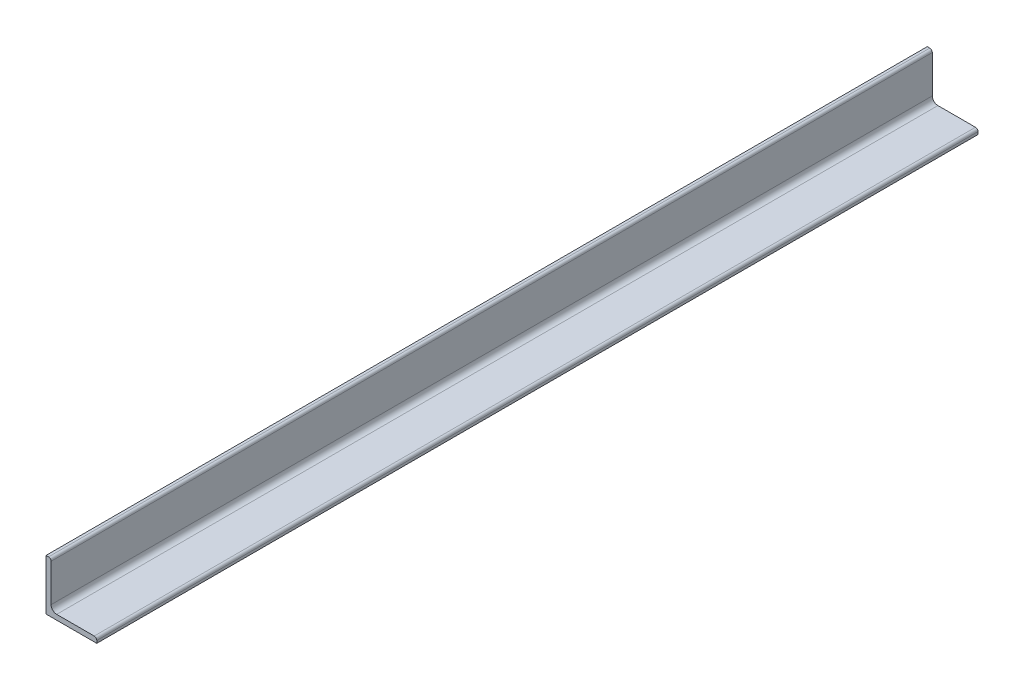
ISO-10303-21;
HEADER;
FILE_DESCRIPTION(('STEP AP214'),'2;1');
FILE_NAME('part.step','',(''),(''),'','','');
FILE_SCHEMA(('AUTOMOTIVE_DESIGN { 1 0 10303 214 1 1 1 1 }'));
ENDSEC;
DATA;
#1=APPLICATION_CONTEXT('core data for automotive mechanical design processes');
#2=APPLICATION_PROTOCOL_DEFINITION('international standard','automotive_design',2000,#1);
#3=PRODUCT_CONTEXT('',#1,'mechanical');
#4=PRODUCT('Part','Part','',(#3));
#5=PRODUCT_RELATED_PRODUCT_CATEGORY('part','',(#4));
#6=PRODUCT_DEFINITION_FORMATION('','',#4);
#7=PRODUCT_DEFINITION_CONTEXT('part definition',#1,'design');
#8=PRODUCT_DEFINITION('design','',#6,#7);
#9=PRODUCT_DEFINITION_SHAPE('','',#8);
#10=(LENGTH_UNIT() NAMED_UNIT(*) SI_UNIT(.MILLI.,.METRE.));
#11=(NAMED_UNIT(*) PLANE_ANGLE_UNIT() SI_UNIT($,.RADIAN.));
#12=(NAMED_UNIT(*) SI_UNIT($,.STERADIAN.) SOLID_ANGLE_UNIT());
#13=UNCERTAINTY_MEASURE_WITH_UNIT(LENGTH_MEASURE(1.E-05),#10,'distance_accuracy_value','');
#14=(GEOMETRIC_REPRESENTATION_CONTEXT(3) GLOBAL_UNCERTAINTY_ASSIGNED_CONTEXT((#13)) GLOBAL_UNIT_ASSIGNED_CONTEXT((#10,
#11,#12)) REPRESENTATION_CONTEXT('',''));
#15=CARTESIAN_POINT('',(0.,0.,0.));
#16=DIRECTION('',(0.,0.,1.));
#17=DIRECTION('',(1.,0.,0.));
#18=AXIS2_PLACEMENT_3D('',#15,#16,#17);
#19=CARTESIAN_POINT('',(2.49999999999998,50.,868.));
#20=DIRECTION('',(0.,-1.,0.));
#21=DIRECTION('',(0.,0.,-1.));
#22=AXIS2_PLACEMENT_3D('',#19,#20,#21);
#23=PLANE('',#22);
#24=DIRECTION('',(-1.,0.,0.));
#25=VECTOR('',#24,1.);
#26=CARTESIAN_POINT('',(2.49999999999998,50.,0.));
#27=LINE('',#26,#25);
#28=CARTESIAN_POINT('',(2.49999999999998,50.,0.));
#29=VERTEX_POINT('',#28);
#30=CARTESIAN_POINT('',(0.,50.,0.));
#31=VERTEX_POINT('',#30);
#32=EDGE_CURVE('E141',#29,#31,#27,.T.);
#33=ORIENTED_EDGE('',*,*,#32,.T.);
#34=DIRECTION('',(0.,0.,-1.));
#35=VECTOR('',#34,1.);
#36=CARTESIAN_POINT('',(0.,50.,868.));
#37=LINE('',#36,#35);
#38=CARTESIAN_POINT('',(0.,50.,868.));
#39=VERTEX_POINT('',#38);
#40=EDGE_CURVE('E11',#39,#31,#37,.T.);
#41=ORIENTED_EDGE('',*,*,#40,.F.);
#42=DIRECTION('',(-1.,0.,0.));
#43=VECTOR('',#42,1.);
#44=CARTESIAN_POINT('',(2.49999999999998,50.,868.));
#45=LINE('',#44,#43);
#46=CARTESIAN_POINT('',(2.49999999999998,50.,868.));
#47=VERTEX_POINT('',#46);
#48=EDGE_CURVE('E157',#47,#39,#45,.T.);
#49=ORIENTED_EDGE('',*,*,#48,.F.);
#50=DIRECTION('',(0.,0.,-1.));
#51=VECTOR('',#50,1.);
#52=CARTESIAN_POINT('',(2.49999999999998,50.,868.));
#53=LINE('',#52,#51);
#54=EDGE_CURVE('E137',#47,#29,#53,.T.);
#55=ORIENTED_EDGE('',*,*,#54,.T.);
#56=EDGE_LOOP('',(#33,#41,#49,#55));
#57=FACE_BOUND('',#56,.T.);
#58=ADVANCED_FACE('F39',(#57),#23,.F.);
#59=CARTESIAN_POINT('',(0.,50.,868.));
#60=DIRECTION('',(1.,0.,0.));
#61=DIRECTION('',(0.,1.,0.));
#62=AXIS2_PLACEMENT_3D('',#59,#60,#61);
#63=PLANE('',#62);
#64=DIRECTION('',(0.,-1.,0.));
#65=VECTOR('',#64,1.);
#66=CARTESIAN_POINT('',(0.,50.,0.));
#67=LINE('',#66,#65);
#68=CARTESIAN_POINT('',(0.,0.,0.));
#69=VERTEX_POINT('',#68);
#70=EDGE_CURVE('E144',#31,#69,#67,.T.);
#71=ORIENTED_EDGE('',*,*,#70,.T.);
#72=DIRECTION('',(0.,0.,-1.));
#73=VECTOR('',#72,1.);
#74=CARTESIAN_POINT('',(0.,0.,868.));
#75=LINE('',#74,#73);
#76=CARTESIAN_POINT('',(0.,0.,868.));
#77=VERTEX_POINT('',#76);
#78=EDGE_CURVE('E47',#77,#69,#75,.T.);
#79=ORIENTED_EDGE('',*,*,#78,.F.);
#80=DIRECTION('',(0.,-1.,0.));
#81=VECTOR('',#80,1.);
#82=CARTESIAN_POINT('',(0.,50.,868.));
#83=LINE('',#82,#81);
#84=EDGE_CURVE('E101',#39,#77,#83,.T.);
#85=ORIENTED_EDGE('',*,*,#84,.F.);
#86=ORIENTED_EDGE('',*,*,#40,.T.);
#87=EDGE_LOOP('',(#71,#79,#85,#86));
#88=FACE_BOUND('',#87,.T.);
#89=ADVANCED_FACE('F200',(#88),#63,.F.);
#90=CARTESIAN_POINT('',(0.,0.,868.));
#91=DIRECTION('',(0.,1.,0.));
#92=DIRECTION('',(0.,0.,1.));
#93=AXIS2_PLACEMENT_3D('',#90,#91,#92);
#94=PLANE('',#93);
#95=DIRECTION('',(1.,0.,0.));
#96=VECTOR('',#95,1.);
#97=CARTESIAN_POINT('',(0.,0.,0.));
#98=LINE('',#97,#96);
#99=CARTESIAN_POINT('',(50.,0.,0.));
#100=VERTEX_POINT('',#99);
#101=EDGE_CURVE('E146',#69,#100,#98,.T.);
#102=ORIENTED_EDGE('',*,*,#101,.T.);
#103=DIRECTION('',(0.,0.,-1.));
#104=VECTOR('',#103,1.);
#105=CARTESIAN_POINT('',(50.,0.,868.));
#106=LINE('',#105,#104);
#107=CARTESIAN_POINT('',(50.,0.,868.));
#108=VERTEX_POINT('',#107);
#109=EDGE_CURVE('E167',#108,#100,#106,.T.);
#110=ORIENTED_EDGE('',*,*,#109,.F.);
#111=DIRECTION('',(1.,0.,0.));
#112=VECTOR('',#111,1.);
#113=CARTESIAN_POINT('',(0.,0.,868.));
#114=LINE('',#113,#112);
#115=EDGE_CURVE('E175',#77,#108,#114,.T.);
#116=ORIENTED_EDGE('',*,*,#115,.F.);
#117=ORIENTED_EDGE('',*,*,#78,.T.);
#118=EDGE_LOOP('',(#102,#110,#116,#117));
#119=FACE_BOUND('',#118,.T.);
#120=ADVANCED_FACE('F173',(#119),#94,.F.);
#121=CARTESIAN_POINT('',(50.,0.,868.));
#122=DIRECTION('',(-1.,0.,0.));
#123=DIRECTION('',(0.,0.,1.));
#124=AXIS2_PLACEMENT_3D('',#121,#122,#123);
#125=PLANE('',#124);
#126=DIRECTION('',(0.,1.,0.));
#127=VECTOR('',#126,1.);
#128=CARTESIAN_POINT('',(50.,0.,0.));
#129=LINE('',#128,#127);
#130=CARTESIAN_POINT('',(50.,2.49999999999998,0.));
#131=VERTEX_POINT('',#130);
#132=EDGE_CURVE('E148',#100,#131,#129,.T.);
#133=ORIENTED_EDGE('',*,*,#132,.T.);
#134=DIRECTION('',(0.,0.,-1.));
#135=VECTOR('',#134,1.);
#136=CARTESIAN_POINT('',(50.,2.49999999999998,868.));
#137=LINE('',#136,#135);
#138=CARTESIAN_POINT('',(50.,2.49999999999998,868.));
#139=VERTEX_POINT('',#138);
#140=EDGE_CURVE('E164',#139,#131,#137,.T.);
#141=ORIENTED_EDGE('',*,*,#140,.F.);
#142=DIRECTION('',(0.,1.,0.));
#143=VECTOR('',#142,1.);
#144=CARTESIAN_POINT('',(50.,0.,868.));
#145=LINE('',#144,#143);
#146=EDGE_CURVE('E191',#108,#139,#145,.T.);
#147=ORIENTED_EDGE('',*,*,#146,.F.);
#148=ORIENTED_EDGE('',*,*,#109,.T.);
#149=EDGE_LOOP('',(#133,#141,#147,#148));
#150=FACE_BOUND('',#149,.T.);
#151=ADVANCED_FACE('F184',(#150),#125,.F.);
#152=CARTESIAN_POINT('',(47.5,2.5,868.));
#153=DIRECTION('',(0.,0.,-1.));
#154=DIRECTION('',(-1.,0.,0.));
#155=AXIS2_PLACEMENT_3D('',#152,#153,#154);
#156=CYLINDRICAL_SURFACE('',#155,2.5);
#157=CARTESIAN_POINT('',(47.5,2.5,0.));
#158=DIRECTION('',(0.,0.,1.));
#159=DIRECTION('',(1.,0.,0.));
#160=AXIS2_PLACEMENT_3D('',#157,#158,#159);
#161=CIRCLE('',#160,2.5);
#162=CARTESIAN_POINT('',(47.5,5.,0.));
#163=VERTEX_POINT('',#162);
#164=EDGE_CURVE('E150',#131,#163,#161,.T.);
#165=ORIENTED_EDGE('',*,*,#164,.T.);
#166=DIRECTION('',(0.,0.,-1.));
#167=VECTOR('',#166,1.);
#168=CARTESIAN_POINT('',(47.5,5.,868.));
#169=LINE('',#168,#167);
#170=CARTESIAN_POINT('',(47.5,5.,868.));
#171=VERTEX_POINT('',#170);
#172=EDGE_CURVE('E161',#171,#163,#169,.T.);
#173=ORIENTED_EDGE('',*,*,#172,.F.);
#174=CARTESIAN_POINT('',(47.5,2.5,868.));
#175=DIRECTION('',(0.,0.,1.));
#176=DIRECTION('',(1.,0.,0.));
#177=AXIS2_PLACEMENT_3D('',#174,#175,#176);
#178=CIRCLE('',#177,2.5);
#179=EDGE_CURVE('E190',#139,#171,#178,.T.);
#180=ORIENTED_EDGE('',*,*,#179,.F.);
#181=ORIENTED_EDGE('',*,*,#140,.T.);
#182=EDGE_LOOP('',(#165,#173,#180,#181));
#183=FACE_BOUND('',#182,.T.);
#184=ADVANCED_FACE('F188',(#183),#156,.T.);
#185=CARTESIAN_POINT('',(47.5,5.,868.));
#186=DIRECTION('',(0.,-1.,0.));
#187=DIRECTION('',(1.,0.,0.));
#188=AXIS2_PLACEMENT_3D('',#185,#186,#187);
#189=PLANE('',#188);
#190=DIRECTION('',(-1.,0.,0.));
#191=VECTOR('',#190,1.);
#192=CARTESIAN_POINT('',(47.5,5.,0.));
#193=LINE('',#192,#191);
#194=CARTESIAN_POINT('',(10.5,4.99999999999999,0.));
#195=VERTEX_POINT('',#194);
#196=EDGE_CURVE('E152',#163,#195,#193,.T.);
#197=ORIENTED_EDGE('',*,*,#196,.T.);
#198=DIRECTION('',(0.,0.,-1.));
#199=VECTOR('',#198,1.);
#200=CARTESIAN_POINT('',(10.5,4.99999999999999,868.));
#201=LINE('',#200,#199);
#202=CARTESIAN_POINT('',(10.5,4.99999999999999,868.));
#203=VERTEX_POINT('',#202);
#204=EDGE_CURVE('E132',#203,#195,#201,.T.);
#205=ORIENTED_EDGE('',*,*,#204,.F.);
#206=DIRECTION('',(-1.,0.,0.));
#207=VECTOR('',#206,1.);
#208=CARTESIAN_POINT('',(47.5,5.,868.));
#209=LINE('',#208,#207);
#210=EDGE_CURVE('E123',#171,#203,#209,.T.);
#211=ORIENTED_EDGE('',*,*,#210,.F.);
#212=ORIENTED_EDGE('',*,*,#172,.T.);
#213=EDGE_LOOP('',(#197,#205,#211,#212));
#214=FACE_BOUND('',#213,.T.);
#215=ADVANCED_FACE('F212',(#214),#189,.F.);
#216=CARTESIAN_POINT('',(10.5,10.5,868.));
#217=DIRECTION('',(0.,0.,-1.));
#218=DIRECTION('',(-1.,0.,0.));
#219=AXIS2_PLACEMENT_3D('',#216,#217,#218);
#220=CYLINDRICAL_SURFACE('',#219,5.5);
#221=CARTESIAN_POINT('',(10.5,10.5,0.));
#222=DIRECTION('',(0.,0.,-1.));
#223=DIRECTION('',(-1.,0.,0.));
#224=AXIS2_PLACEMENT_3D('',#221,#222,#223);
#225=CIRCLE('',#224,5.5);
#226=CARTESIAN_POINT('',(5.,10.5,0.));
#227=VERTEX_POINT('',#226);
#228=EDGE_CURVE('E131',#195,#227,#225,.T.);
#229=ORIENTED_EDGE('',*,*,#228,.T.);
#230=DIRECTION('',(0.,0.,-1.));
#231=VECTOR('',#230,1.);
#232=CARTESIAN_POINT('',(5.,10.5,868.));
#233=LINE('',#232,#231);
#234=CARTESIAN_POINT('',(5.,10.5,868.));
#235=VERTEX_POINT('',#234);
#236=EDGE_CURVE('E128',#235,#227,#233,.T.);
#237=ORIENTED_EDGE('',*,*,#236,.F.);
#238=CARTESIAN_POINT('',(10.5,10.5,868.));
#239=DIRECTION('',(0.,0.,-1.));
#240=DIRECTION('',(-1.,0.,0.));
#241=AXIS2_PLACEMENT_3D('',#238,#239,#240);
#242=CIRCLE('',#241,5.5);
#243=EDGE_CURVE('E117',#203,#235,#242,.T.);
#244=ORIENTED_EDGE('',*,*,#243,.F.);
#245=ORIENTED_EDGE('',*,*,#204,.T.);
#246=EDGE_LOOP('',(#229,#237,#244,#245));
#247=FACE_BOUND('',#246,.T.);
#248=ADVANCED_FACE('F129',(#247),#220,.F.);
#249=CARTESIAN_POINT('',(5.,10.5,868.));
#250=DIRECTION('',(-1.,0.,0.));
#251=DIRECTION('',(0.,-1.,0.));
#252=AXIS2_PLACEMENT_3D('',#249,#250,#251);
#253=PLANE('',#252);
#254=DIRECTION('',(0.,1.,0.));
#255=VECTOR('',#254,1.);
#256=CARTESIAN_POINT('',(5.,10.5,0.));
#257=LINE('',#256,#255);
#258=CARTESIAN_POINT('',(5.,47.5,0.));
#259=VERTEX_POINT('',#258);
#260=EDGE_CURVE('E87',#227,#259,#257,.T.);
#261=ORIENTED_EDGE('',*,*,#260,.T.);
#262=DIRECTION('',(0.,0.,-1.));
#263=VECTOR('',#262,1.);
#264=CARTESIAN_POINT('',(5.,47.5,868.));
#265=LINE('',#264,#263);
#266=CARTESIAN_POINT('',(5.,47.5,868.));
#267=VERTEX_POINT('',#266);
#268=EDGE_CURVE('E133',#267,#259,#265,.T.);
#269=ORIENTED_EDGE('',*,*,#268,.F.);
#270=DIRECTION('',(0.,1.,0.));
#271=VECTOR('',#270,1.);
#272=CARTESIAN_POINT('',(5.,10.5,868.));
#273=LINE('',#272,#271);
#274=EDGE_CURVE('E121',#235,#267,#273,.T.);
#275=ORIENTED_EDGE('',*,*,#274,.F.);
#276=ORIENTED_EDGE('',*,*,#236,.T.);
#277=EDGE_LOOP('',(#261,#269,#275,#276));
#278=FACE_BOUND('',#277,.T.);
#279=ADVANCED_FACE('F135',(#278),#253,.F.);
#280=CARTESIAN_POINT('',(2.5,47.5,868.));
#281=DIRECTION('',(0.,0.,-1.));
#282=DIRECTION('',(-1.,0.,0.));
#283=AXIS2_PLACEMENT_3D('',#280,#281,#282);
#284=CYLINDRICAL_SURFACE('',#283,2.5);
#285=CARTESIAN_POINT('',(2.5,47.5,0.));
#286=DIRECTION('',(0.,0.,1.));
#287=DIRECTION('',(1.,0.,0.));
#288=AXIS2_PLACEMENT_3D('',#285,#286,#287);
#289=CIRCLE('',#288,2.5);
#290=EDGE_CURVE('E93',#259,#29,#289,.T.);
#291=ORIENTED_EDGE('',*,*,#290,.T.);
#292=ORIENTED_EDGE('',*,*,#54,.F.);
#293=CARTESIAN_POINT('',(2.5,47.5,868.));
#294=DIRECTION('',(0.,0.,1.));
#295=DIRECTION('',(1.,0.,0.));
#296=AXIS2_PLACEMENT_3D('',#293,#294,#295);
#297=CIRCLE('',#296,2.5);
#298=EDGE_CURVE('E55',#267,#47,#297,.T.);
#299=ORIENTED_EDGE('',*,*,#298,.F.);
#300=ORIENTED_EDGE('',*,*,#268,.T.);
#301=EDGE_LOOP('',(#291,#292,#299,#300));
#302=FACE_BOUND('',#301,.T.);
#303=ADVANCED_FACE('F220',(#302),#284,.T.);
#304=CARTESIAN_POINT('',(47.5,2.5,868.));
#305=DIRECTION('',(0.,0.,1.));
#306=DIRECTION('',(1.,0.,0.));
#307=AXIS2_PLACEMENT_3D('',#304,#305,#306);
#308=PLANE('',#307);
#309=ORIENTED_EDGE('',*,*,#48,.T.);
#310=ORIENTED_EDGE('',*,*,#84,.T.);
#311=ORIENTED_EDGE('',*,*,#115,.T.);
#312=ORIENTED_EDGE('',*,*,#146,.T.);
#313=ORIENTED_EDGE('',*,*,#179,.T.);
#314=ORIENTED_EDGE('',*,*,#210,.T.);
#315=ORIENTED_EDGE('',*,*,#243,.T.);
#316=ORIENTED_EDGE('',*,*,#274,.T.);
#317=ORIENTED_EDGE('',*,*,#298,.T.);
#318=EDGE_LOOP('',(#309,#310,#311,#312,#313,#314,#315,#316,#317));
#319=FACE_BOUND('',#318,.T.);
#320=ADVANCED_FACE('F119',(#319),#308,.T.);
#321=CARTESIAN_POINT('',(47.5,2.5,0.));
#322=DIRECTION('',(0.,0.,1.));
#323=DIRECTION('',(1.,0.,0.));
#324=AXIS2_PLACEMENT_3D('',#321,#322,#323);
#325=PLANE('',#324);
#326=ORIENTED_EDGE('',*,*,#32,.F.);
#327=ORIENTED_EDGE('',*,*,#290,.F.);
#328=ORIENTED_EDGE('',*,*,#260,.F.);
#329=ORIENTED_EDGE('',*,*,#228,.F.);
#330=ORIENTED_EDGE('',*,*,#196,.F.);
#331=ORIENTED_EDGE('',*,*,#164,.F.);
#332=ORIENTED_EDGE('',*,*,#132,.F.);
#333=ORIENTED_EDGE('',*,*,#101,.F.);
#334=ORIENTED_EDGE('',*,*,#70,.F.);
#335=EDGE_LOOP('',(#326,#327,#328,#329,#330,#331,#332,#333,#334));
#336=FACE_BOUND('',#335,.T.);
#337=ADVANCED_FACE('F179',(#336),#325,.F.);
#338=CLOSED_SHELL('',(#58,#89,#120,#151,#184,#215,#248,#279,#303,#320,#337));
#339=MANIFOLD_SOLID_BREP('B2',#338);
#340=ADVANCED_BREP_SHAPE_REPRESENTATION('',(#18,#339),#14);
#341=SHAPE_DEFINITION_REPRESENTATION(#9,#340);
ENDSEC;
END-ISO-10303-21;
